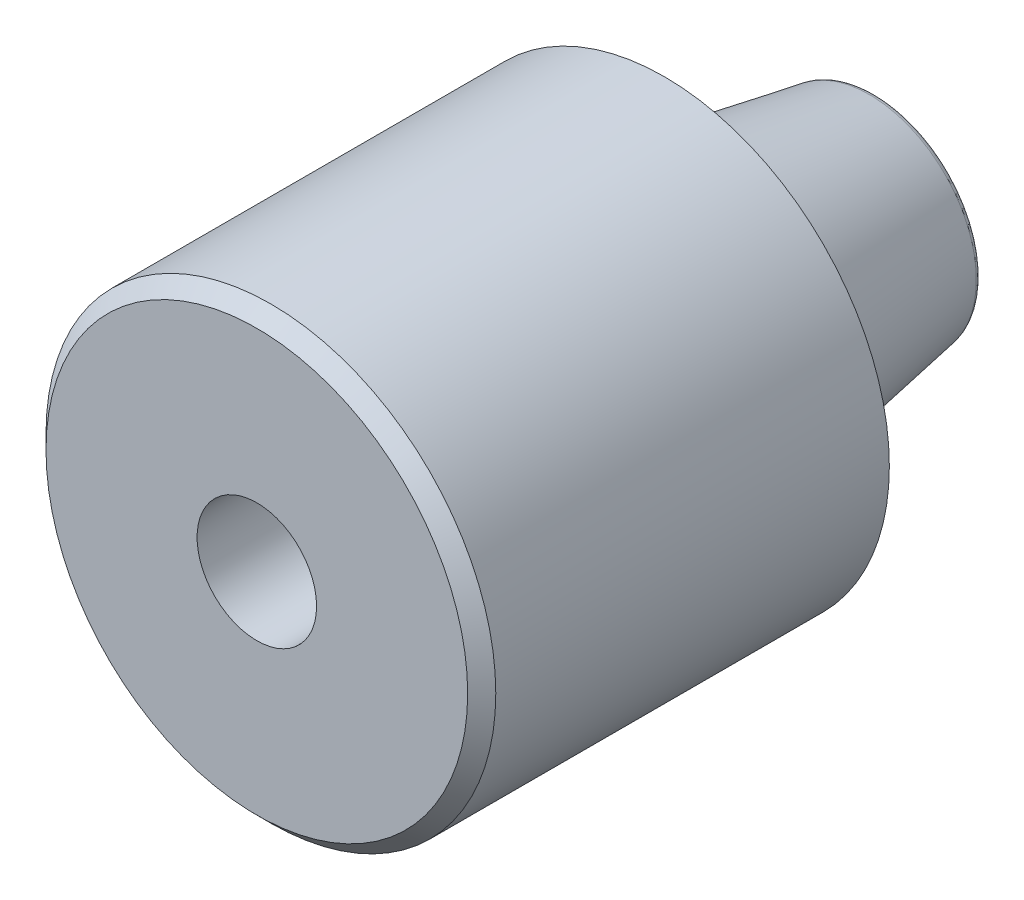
ISO-10303-21;
HEADER;
FILE_DESCRIPTION(('STEP AP214'),'2;1');
FILE_NAME('part.step','',(''),(''),'','','');
FILE_SCHEMA(('AUTOMOTIVE_DESIGN { 1 0 10303 214 1 1 1 1 }'));
ENDSEC;
DATA;
#1=APPLICATION_CONTEXT('core data for automotive mechanical design processes');
#2=APPLICATION_PROTOCOL_DEFINITION('international standard','automotive_design',2000,#1);
#3=PRODUCT_CONTEXT('',#1,'mechanical');
#4=PRODUCT('Part','Part','',(#3));
#5=PRODUCT_RELATED_PRODUCT_CATEGORY('part','',(#4));
#6=PRODUCT_DEFINITION_FORMATION('','',#4);
#7=PRODUCT_DEFINITION_CONTEXT('part definition',#1,'design');
#8=PRODUCT_DEFINITION('design','',#6,#7);
#9=PRODUCT_DEFINITION_SHAPE('','',#8);
#10=(LENGTH_UNIT() NAMED_UNIT(*) SI_UNIT(.MILLI.,.METRE.));
#11=(NAMED_UNIT(*) PLANE_ANGLE_UNIT() SI_UNIT($,.RADIAN.));
#12=(NAMED_UNIT(*) SI_UNIT($,.STERADIAN.) SOLID_ANGLE_UNIT());
#13=UNCERTAINTY_MEASURE_WITH_UNIT(LENGTH_MEASURE(1.E-05),#10,'distance_accuracy_value','');
#14=(GEOMETRIC_REPRESENTATION_CONTEXT(3) GLOBAL_UNCERTAINTY_ASSIGNED_CONTEXT((#13)) GLOBAL_UNIT_ASSIGNED_CONTEXT((#10,
#11,#12)) REPRESENTATION_CONTEXT('',''));
#15=CARTESIAN_POINT('',(0.,0.,0.));
#16=DIRECTION('',(0.,0.,1.));
#17=DIRECTION('',(1.,0.,0.));
#18=AXIS2_PLACEMENT_3D('',#15,#16,#17);
#19=CARTESIAN_POINT('',(1.56226912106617E-13,0.,22.3725830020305));
#20=DIRECTION('',(0.,0.,-1.));
#21=DIRECTION('',(1.,0.,0.));
#22=AXIS2_PLACEMENT_3D('',#19,#20,#21);
#23=CONICAL_SURFACE('',#22,22.6274169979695,0.785398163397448);
#24=CARTESIAN_POINT('',(2.09488880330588E-13,0.,30.));
#25=DIRECTION('',(0.,0.,-1.));
#26=DIRECTION('',(-1.,0.,0.));
#27=AXIS2_PLACEMENT_3D('',#24,#25,#26);
#28=CIRCLE('',#27,15.);
#29=CARTESIAN_POINT('',(-14.9999999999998,0.,30.));
#30=VERTEX_POINT('',#29);
#31=CARTESIAN_POINT('',(15.,0.,30.));
#32=VERTEX_POINT('',#31);
#33=EDGE_CURVE('E59',#30,#32,#28,.T.);
#34=ORIENTED_EDGE('',*,*,#33,.T.);
#35=CARTESIAN_POINT('',(15.0000010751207,0.,29.9999989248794));
#36=CARTESIAN_POINT('',(16.0000024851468,0.,28.9999975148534));
#37=B_SPLINE_CURVE_WITH_KNOTS('',1,(#35,#36),.UNSPECIFIED.,.F.,.F.,(2,2),(0.662912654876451,
0.707106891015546),.UNSPECIFIED.);
#38=CARTESIAN_POINT('',(16.,0.,29.));
#39=VERTEX_POINT('',#38);
#40=EDGE_CURVE('E46',#32,#39,#37,.T.);
#41=ORIENTED_EDGE('',*,*,#40,.T.);
#42=CARTESIAN_POINT('',(2.02505917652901E-13,0.,29.));
#43=DIRECTION('',(0.,0.,1.));
#44=DIRECTION('',(-1.,0.,0.));
#45=AXIS2_PLACEMENT_3D('',#42,#43,#44);
#46=CIRCLE('',#45,16.);
#47=CARTESIAN_POINT('',(-16.,0.,29.));
#48=VERTEX_POINT('',#47);
#49=EDGE_CURVE('E97',#39,#48,#46,.T.);
#50=ORIENTED_EDGE('',*,*,#49,.T.);
#51=CARTESIAN_POINT('',(2.02505917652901E-13,0.,29.));
#52=DIRECTION('',(0.,0.,1.));
#53=DIRECTION('',(-1.,0.,0.));
#54=AXIS2_PLACEMENT_3D('',#51,#52,#53);
#55=CIRCLE('',#54,16.);
#56=EDGE_CURVE('E11',#48,#39,#55,.T.);
#57=ORIENTED_EDGE('',*,*,#56,.T.);
#58=ORIENTED_EDGE('',*,*,#40,.F.);
#59=CARTESIAN_POINT('',(2.09488880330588E-13,0.,30.));
#60=DIRECTION('',(0.,0.,-1.));
#61=DIRECTION('',(-1.,0.,0.));
#62=AXIS2_PLACEMENT_3D('',#59,#60,#61);
#63=CIRCLE('',#62,15.);
#64=EDGE_CURVE('E94',#32,#30,#63,.T.);
#65=ORIENTED_EDGE('',*,*,#64,.T.);
#66=EDGE_LOOP('',(#34,#41,#50,#57,#58,#65));
#67=FACE_BOUND('',#66,.T.);
#68=ADVANCED_FACE('F38',(#67),#23,.T.);
#69=CARTESIAN_POINT('',(1.08235921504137E-13,0.,15.5));
#70=DIRECTION('',(0.,0.,-1.));
#71=DIRECTION('',(-1.,0.,0.));
#72=AXIS2_PLACEMENT_3D('',#69,#70,#71);
#73=CYLINDRICAL_SURFACE('',#72,16.);
#74=ORIENTED_EDGE('',*,*,#49,.F.);
#75=ORIENTED_EDGE('',*,*,#56,.F.);
#76=CARTESIAN_POINT('',(-16.,0.,29.0000010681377));
#77=CARTESIAN_POINT('',(-16.,0.,1.00000036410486));
#78=B_SPLINE_CURVE_WITH_KNOTS('',1,(#76,#77),.UNSPECIFIED.,.F.,.F.,(2,2),(0.0833333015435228,
0.916666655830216),.UNSPECIFIED.);
#79=CARTESIAN_POINT('',(-16.,0.,1.00000000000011));
#80=VERTEX_POINT('',#79);
#81=EDGE_CURVE('E132',#48,#80,#78,.T.);
#82=ORIENTED_EDGE('',*,*,#81,.T.);
#83=CARTESIAN_POINT('',(0.,0.,1.));
#84=DIRECTION('',(0.,0.,-1.));
#85=DIRECTION('',(-1.,0.,0.));
#86=AXIS2_PLACEMENT_3D('',#83,#84,#85);
#87=CIRCLE('',#86,16.);
#88=EDGE_CURVE('E137',#80,#80,#87,.T.);
#89=ORIENTED_EDGE('',*,*,#88,.F.);
#90=ORIENTED_EDGE('',*,*,#81,.F.);
#91=EDGE_LOOP('',(#74,#75,#82,#89,#90));
#92=FACE_BOUND('',#91,.T.);
#93=ADVANCED_FACE('F182',(#92),#73,.T.);
#94=CARTESIAN_POINT('',(-19.5,-31.1769145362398,30.));
#95=DIRECTION('',(0.,0.,1.));
#96=DIRECTION('',(1.,0.,0.));
#97=AXIS2_PLACEMENT_3D('',#94,#95,#96);
#98=PLANE('',#97);
#99=CARTESIAN_POINT('',(0.,0.,29.9999999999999));
#100=DIRECTION('',(0.,0.,1.));
#101=DIRECTION('',(1.,0.,0.));
#102=AXIS2_PLACEMENT_3D('',#99,#100,#101);
#103=CIRCLE('',#102,4.24999999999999);
#104=CARTESIAN_POINT('',(4.24999999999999,0.,29.9999999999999));
#105=VERTEX_POINT('',#104);
#106=EDGE_CURVE('E95',#105,#105,#103,.T.);
#107=ORIENTED_EDGE('',*,*,#106,.F.);
#108=EDGE_LOOP('',(#107));
#109=FACE_BOUND('',#108,.T.);
#110=ORIENTED_EDGE('',*,*,#64,.F.);
#111=ORIENTED_EDGE('',*,*,#33,.F.);
#112=EDGE_LOOP('',(#110,#111));
#113=FACE_BOUND('',#112,.T.);
#114=ADVANCED_FACE('F185',(#109,#113),#98,.T.);
#115=CARTESIAN_POINT('',(0.,0.,-13.5));
#116=DIRECTION('',(0.,0.,-1.));
#117=DIRECTION('',(-1.,0.,0.));
#118=AXIS2_PLACEMENT_3D('',#115,#116,#117);
#119=TOROIDAL_SURFACE('',#118,7.11187245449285,0.5);
#120=CARTESIAN_POINT('',(0.,0.,-13.5868240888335));
#121=DIRECTION('',(0.,0.,-1.));
#122=DIRECTION('',(-1.,0.,0.));
#123=AXIS2_PLACEMENT_3D('',#120,#121,#122);
#124=CIRCLE('',#123,7.60427633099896);
#125=CARTESIAN_POINT('',(-7.60427633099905,0.,-13.5868240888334));
#126=VERTEX_POINT('',#125);
#127=EDGE_CURVE('E138',#126,#126,#124,.T.);
#128=ORIENTED_EDGE('',*,*,#127,.T.);
#129=CARTESIAN_POINT('',(-7.60427633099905,0.,-13.5868240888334));
#130=CARTESIAN_POINT('',(-7.53142227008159,0.,-13.9999999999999));
#131=CARTESIAN_POINT('',(-7.11187245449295,0.,-14.));
#132=(BOUNDED_CURVE() B_SPLINE_CURVE(2,(#129,#130,#131),.UNSPECIFIED.,.F.,
.F.) B_SPLINE_CURVE_WITH_KNOTS((3,3),(0.,0.5),
.UNSPECIFIED.) CURVE() GEOMETRIC_REPRESENTATION_ITEM() RATIONAL_B_SPLINE_CURVE((1.,
0.766044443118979,1.)) REPRESENTATION_ITEM(''));
#133=CARTESIAN_POINT('',(-7.11187245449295,0.,-14.));
#134=VERTEX_POINT('',#133);
#135=EDGE_CURVE('E121',#126,#134,#132,.T.);
#136=ORIENTED_EDGE('',*,*,#135,.T.);
#137=CARTESIAN_POINT('',(0.,0.,-14.));
#138=DIRECTION('',(0.,0.,1.));
#139=DIRECTION('',(-1.,0.,0.));
#140=AXIS2_PLACEMENT_3D('',#137,#138,#139);
#141=CIRCLE('',#140,7.11187245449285);
#142=EDGE_CURVE('E127',#134,#134,#141,.T.);
#143=ORIENTED_EDGE('',*,*,#142,.T.);
#144=ORIENTED_EDGE('',*,*,#135,.F.);
#145=EDGE_LOOP('',(#128,#136,#143,#144));
#146=FACE_BOUND('',#145,.T.);
#147=ADVANCED_FACE('F187',(#146),#119,.T.);
#148=CARTESIAN_POINT('',(0.,0.,0.));
#149=DIRECTION('',(0.,0.,1.));
#150=DIRECTION('',(-1.,0.,0.));
#151=AXIS2_PLACEMENT_3D('',#148,#149,#150);
#152=CONICAL_SURFACE('',#151,10.,0.174532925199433);
#153=ORIENTED_EDGE('',*,*,#127,.F.);
#154=CARTESIAN_POINT('',(-7.60427633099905,0.,-13.5868240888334));
#155=CARTESIAN_POINT('',(-10.,0.,0.));
#156=B_SPLINE_CURVE_WITH_KNOTS('',1,(#154,#155),.UNSPECIFIED.,.F.,.F.,(2,2),(0.,1.),.UNSPECIFIED.);
#157=CARTESIAN_POINT('',(-10.,0.,0.));
#158=VERTEX_POINT('',#157);
#159=EDGE_CURVE('E110',#126,#158,#156,.T.);
#160=ORIENTED_EDGE('',*,*,#159,.T.);
#161=CARTESIAN_POINT('',(0.,0.,0.));
#162=DIRECTION('',(0.,0.,-1.));
#163=DIRECTION('',(-1.,0.,0.));
#164=AXIS2_PLACEMENT_3D('',#161,#162,#163);
#165=CIRCLE('',#164,10.);
#166=EDGE_CURVE('E116',#158,#158,#165,.T.);
#167=ORIENTED_EDGE('',*,*,#166,.T.);
#168=ORIENTED_EDGE('',*,*,#159,.F.);
#169=EDGE_LOOP('',(#153,#160,#167,#168));
#170=FACE_BOUND('',#169,.T.);
#171=ADVANCED_FACE('F194',(#170),#152,.T.);
#172=CARTESIAN_POINT('',(16.3573066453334,-14.7817493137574,-14.0000000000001));
#173=DIRECTION('',(0.,0.,-1.));
#174=DIRECTION('',(-1.,0.,0.));
#175=AXIS2_PLACEMENT_3D('',#172,#173,#174);
#176=PLANE('',#175);
#177=ORIENTED_EDGE('',*,*,#142,.F.);
#178=EDGE_LOOP('',(#177));
#179=FACE_BOUND('',#178,.T.);
#180=ADVANCED_FACE('F222',(#179),#176,.T.);
#181=CARTESIAN_POINT('',(0.,0.,0.5));
#182=DIRECTION('',(0.,0.,-1.));
#183=DIRECTION('',(-1.,0.,0.));
#184=AXIS2_PLACEMENT_3D('',#181,#182,#183);
#185=CYLINDRICAL_SURFACE('',#184,10.);
#186=CARTESIAN_POINT('',(0.,0.,1.));
#187=DIRECTION('',(0.,0.,1.));
#188=DIRECTION('',(-1.,0.,0.));
#189=AXIS2_PLACEMENT_3D('',#186,#187,#188);
#190=CIRCLE('',#189,10.);
#191=CARTESIAN_POINT('',(-10.,0.,1.00000000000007));
#192=VERTEX_POINT('',#191);
#193=EDGE_CURVE('E105',#192,#192,#190,.T.);
#194=ORIENTED_EDGE('',*,*,#193,.F.);
#195=CARTESIAN_POINT('',(-10.,0.,1.00000305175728));
#196=CARTESIAN_POINT('',(-10.,0.,5.31746945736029E-07));
#197=B_SPLINE_CURVE_WITH_KNOTS('',1,(#195,#196),.UNSPECIFIED.,.F.,.F.,(2,2),(0.0833307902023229,
0.91666622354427),.UNSPECIFIED.);
#198=EDGE_CURVE('E102',#192,#158,#197,.T.);
#199=ORIENTED_EDGE('',*,*,#198,.T.);
#200=ORIENTED_EDGE('',*,*,#166,.F.);
#201=ORIENTED_EDGE('',*,*,#198,.F.);
#202=EDGE_LOOP('',(#194,#199,#200,#201));
#203=FACE_BOUND('',#202,.T.);
#204=ADVANCED_FACE('F231',(#203),#185,.T.);
#205=CARTESIAN_POINT('',(36.8,-33.2553755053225,0.999999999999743));
#206=DIRECTION('',(0.,0.,-1.));
#207=DIRECTION('',(-1.,0.,0.));
#208=AXIS2_PLACEMENT_3D('',#205,#206,#207);
#209=PLANE('',#208);
#210=ORIENTED_EDGE('',*,*,#88,.T.);
#211=EDGE_LOOP('',(#210));
#212=FACE_BOUND('',#211,.T.);
#213=ORIENTED_EDGE('',*,*,#193,.T.);
#214=EDGE_LOOP('',(#213));
#215=FACE_BOUND('',#214,.T.);
#216=ADVANCED_FACE('F88',(#212,#215),#209,.T.);
#217=CARTESIAN_POINT('',(0.,0.,7.99999999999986));
#218=DIRECTION('',(0.,0.,1.));
#219=DIRECTION('',(1.,0.,0.));
#220=AXIS2_PLACEMENT_3D('',#217,#218,#219);
#221=CONICAL_SURFACE('',#220,4.24999999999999,1.02974425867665);
#222=CARTESIAN_POINT('',(0.,0.,5.44634236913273));
#223=VERTEX_POINT('',#222);
#224=VERTEX_LOOP('',#223);
#225=FACE_BOUND('',#224,.T.);
#226=CARTESIAN_POINT('',(0.,0.,7.99999999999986));
#227=DIRECTION('',(0.,0.,1.));
#228=DIRECTION('',(1.,0.,0.));
#229=AXIS2_PLACEMENT_3D('',#226,#227,#228);
#230=CIRCLE('',#229,4.24999999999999);
#231=CARTESIAN_POINT('',(4.24999999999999,0.,7.99999999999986));
#232=VERTEX_POINT('',#231);
#233=EDGE_CURVE('E92',#232,#232,#230,.T.);
#234=ORIENTED_EDGE('',*,*,#233,.T.);
#235=EDGE_LOOP('',(#234));
#236=FACE_BOUND('',#235,.T.);
#237=ADVANCED_FACE('F84',(#225,#236),#221,.F.);
#238=CARTESIAN_POINT('',(0.,0.,29.9999999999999));
#239=DIRECTION('',(0.,0.,1.));
#240=DIRECTION('',(1.,0.,0.));
#241=AXIS2_PLACEMENT_3D('',#238,#239,#240);
#242=CYLINDRICAL_SURFACE('',#241,4.24999999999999);
#243=ORIENTED_EDGE('',*,*,#233,.F.);
#244=EDGE_LOOP('',(#243));
#245=FACE_BOUND('',#244,.T.);
#246=ORIENTED_EDGE('',*,*,#106,.T.);
#247=EDGE_LOOP('',(#246));
#248=FACE_BOUND('',#247,.T.);
#249=ADVANCED_FACE('F87',(#245,#248),#242,.F.);
#250=CLOSED_SHELL('',(#68,#93,#114,#147,#171,#180,#204,#216,#237,#249));
#251=MANIFOLD_SOLID_BREP('B2',#250);
#252=ADVANCED_BREP_SHAPE_REPRESENTATION('',(#18,#251),#14);
#253=SHAPE_DEFINITION_REPRESENTATION(#9,#252);
ENDSEC;
END-ISO-10303-21;
